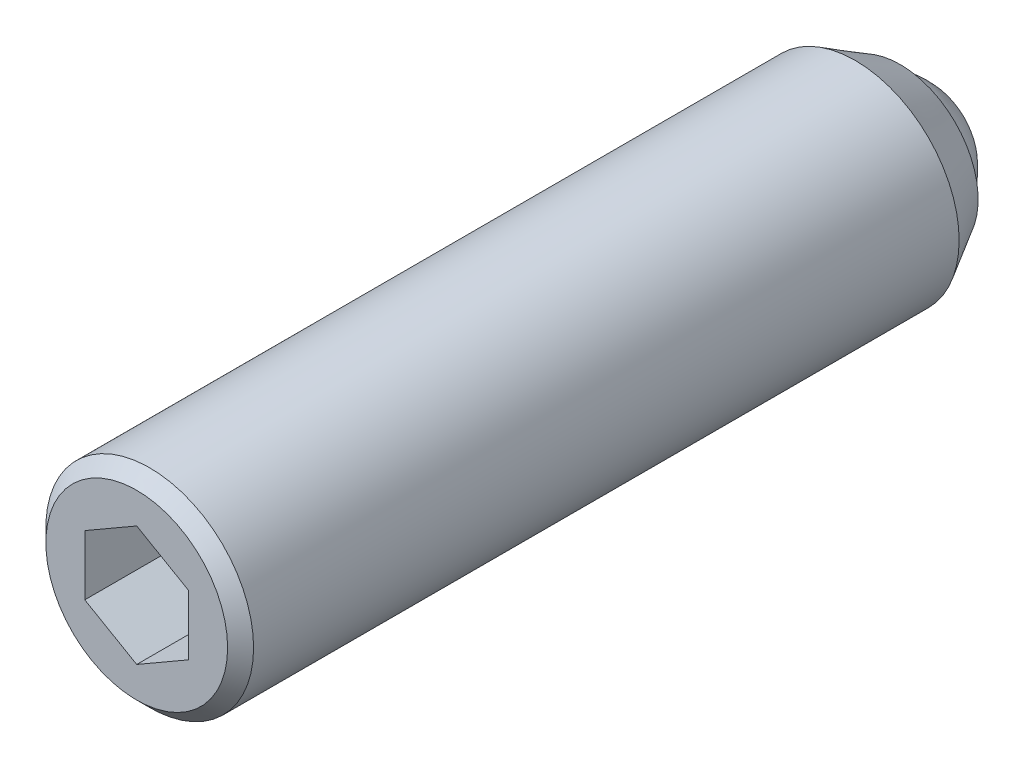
ISO-10303-21;
HEADER;
FILE_DESCRIPTION(('STEP AP214'),'2;1');
FILE_NAME('part.step','',(''),(''),'','','');
FILE_SCHEMA(('AUTOMOTIVE_DESIGN { 1 0 10303 214 1 1 1 1 }'));
ENDSEC;
DATA;
#1=APPLICATION_CONTEXT('core data for automotive mechanical design processes');
#2=APPLICATION_PROTOCOL_DEFINITION('international standard','automotive_design',2000,#1);
#3=PRODUCT_CONTEXT('',#1,'mechanical');
#4=PRODUCT('Part','Part','',(#3));
#5=PRODUCT_RELATED_PRODUCT_CATEGORY('part','',(#4));
#6=PRODUCT_DEFINITION_FORMATION('','',#4);
#7=PRODUCT_DEFINITION_CONTEXT('part definition',#1,'design');
#8=PRODUCT_DEFINITION('design','',#6,#7);
#9=PRODUCT_DEFINITION_SHAPE('','',#8);
#10=(LENGTH_UNIT() NAMED_UNIT(*) SI_UNIT(.MILLI.,.METRE.));
#11=(NAMED_UNIT(*) PLANE_ANGLE_UNIT() SI_UNIT($,.RADIAN.));
#12=(NAMED_UNIT(*) SI_UNIT($,.STERADIAN.) SOLID_ANGLE_UNIT());
#13=UNCERTAINTY_MEASURE_WITH_UNIT(LENGTH_MEASURE(1.E-05),#10,'distance_accuracy_value','');
#14=(GEOMETRIC_REPRESENTATION_CONTEXT(3) GLOBAL_UNCERTAINTY_ASSIGNED_CONTEXT((#13)) GLOBAL_UNIT_ASSIGNED_CONTEXT((#10,
#11,#12)) REPRESENTATION_CONTEXT('',''));
#15=CARTESIAN_POINT('',(0.,0.,0.));
#16=DIRECTION('',(0.,0.,1.));
#17=DIRECTION('',(1.,0.,0.));
#18=AXIS2_PLACEMENT_3D('',#15,#16,#17);
#19=CARTESIAN_POINT('',(2.,1.15470053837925,28.75));
#20=DIRECTION('',(0.5,0.86602540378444,0.));
#21=DIRECTION('',(0.86602540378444,-0.5,0.));
#22=AXIS2_PLACEMENT_3D('',#19,#20,#21);
#23=PLANE('',#22);
#24=DIRECTION('',(0.,0.,1.));
#25=VECTOR('',#24,1.);
#26=CARTESIAN_POINT('',(2.,1.15470053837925,28.75));
#27=LINE('',#26,#25);
#28=CARTESIAN_POINT('',(2.,1.15470053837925,27.25));
#29=VERTEX_POINT('',#28);
#30=CARTESIAN_POINT('',(2.,1.15470053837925,31.25));
#31=VERTEX_POINT('',#30);
#32=EDGE_CURVE('E68',#29,#31,#27,.T.);
#33=ORIENTED_EDGE('',*,*,#32,.T.);
#34=DIRECTION('',(-0.86602540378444,0.5,0.));
#35=VECTOR('',#34,1.);
#36=CARTESIAN_POINT('',(2.,1.15470053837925,31.25));
#37=LINE('',#36,#35);
#38=CARTESIAN_POINT('',(0.,2.3094010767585,31.25));
#39=VERTEX_POINT('',#38);
#40=EDGE_CURVE('E29',#31,#39,#37,.T.);
#41=ORIENTED_EDGE('',*,*,#40,.T.);
#42=DIRECTION('',(0.,0.,1.));
#43=VECTOR('',#42,1.);
#44=CARTESIAN_POINT('',(0.,2.3094010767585,28.75));
#45=LINE('',#44,#43);
#46=CARTESIAN_POINT('',(0.,2.3094010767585,27.25));
#47=VERTEX_POINT('',#46);
#48=EDGE_CURVE('E80',#47,#39,#45,.T.);
#49=ORIENTED_EDGE('',*,*,#48,.F.);
#50=DIRECTION('',(-0.86602540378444,0.5,0.));
#51=VECTOR('',#50,1.);
#52=CARTESIAN_POINT('',(2.,1.15470053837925,27.25));
#53=LINE('',#52,#51);
#54=EDGE_CURVE('E79',#29,#47,#53,.T.);
#55=ORIENTED_EDGE('',*,*,#54,.F.);
#56=EDGE_LOOP('',(#33,#41,#49,#55));
#57=FACE_BOUND('',#56,.T.);
#58=ADVANCED_FACE('F14',(#57),#23,.F.);
#59=CARTESIAN_POINT('',(2.,-1.15470053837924,28.75));
#60=DIRECTION('',(1.,0.,0.));
#61=DIRECTION('',(0.,0.,1.));
#62=AXIS2_PLACEMENT_3D('',#59,#60,#61);
#63=PLANE('',#62);
#64=DIRECTION('',(0.,0.,1.));
#65=VECTOR('',#64,1.);
#66=CARTESIAN_POINT('',(2.,-1.15470053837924,28.75));
#67=LINE('',#66,#65);
#68=CARTESIAN_POINT('',(2.,-1.15470053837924,27.25));
#69=VERTEX_POINT('',#68);
#70=CARTESIAN_POINT('',(2.,-1.15470053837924,31.25));
#71=VERTEX_POINT('',#70);
#72=EDGE_CURVE('E76',#69,#71,#67,.T.);
#73=ORIENTED_EDGE('',*,*,#72,.T.);
#74=DIRECTION('',(0.,1.,0.));
#75=VECTOR('',#74,1.);
#76=CARTESIAN_POINT('',(2.,-1.15470053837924,31.25));
#77=LINE('',#76,#75);
#78=EDGE_CURVE('E75',#71,#31,#77,.T.);
#79=ORIENTED_EDGE('',*,*,#78,.T.);
#80=ORIENTED_EDGE('',*,*,#32,.F.);
#81=DIRECTION('',(0.,1.,0.));
#82=VECTOR('',#81,1.);
#83=CARTESIAN_POINT('',(2.,-1.15470053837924,27.25));
#84=LINE('',#83,#82);
#85=EDGE_CURVE('E72',#69,#29,#84,.T.);
#86=ORIENTED_EDGE('',*,*,#85,.F.);
#87=EDGE_LOOP('',(#73,#79,#80,#86));
#88=FACE_BOUND('',#87,.T.);
#89=ADVANCED_FACE('F70',(#88),#63,.F.);
#90=CARTESIAN_POINT('',(2.,-1.15470053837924,28.75));
#91=DIRECTION('',(-0.5,0.866025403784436,0.));
#92=DIRECTION('',(0.866025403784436,0.5,0.));
#93=AXIS2_PLACEMENT_3D('',#90,#91,#92);
#94=PLANE('',#93);
#95=DIRECTION('',(0.,0.,1.));
#96=VECTOR('',#95,1.);
#97=CARTESIAN_POINT('',(0.,-2.30940107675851,28.75));
#98=LINE('',#97,#96);
#99=CARTESIAN_POINT('',(0.,-2.30940107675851,27.25));
#100=VERTEX_POINT('',#99);
#101=CARTESIAN_POINT('',(0.,-2.30940107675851,31.25));
#102=VERTEX_POINT('',#101);
#103=EDGE_CURVE('E122',#100,#102,#98,.T.);
#104=ORIENTED_EDGE('',*,*,#103,.T.);
#105=DIRECTION('',(-0.866025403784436,-0.5,0.));
#106=VECTOR('',#105,1.);
#107=CARTESIAN_POINT('',(2.,-1.15470053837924,31.25));
#108=LINE('',#107,#106);
#109=EDGE_CURVE('E113',#71,#102,#108,.T.);
#110=ORIENTED_EDGE('',*,*,#109,.F.);
#111=ORIENTED_EDGE('',*,*,#72,.F.);
#112=DIRECTION('',(0.866025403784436,0.5,0.));
#113=VECTOR('',#112,1.);
#114=CARTESIAN_POINT('',(0.,-2.30940107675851,27.25));
#115=LINE('',#114,#113);
#116=EDGE_CURVE('E89',#100,#69,#115,.T.);
#117=ORIENTED_EDGE('',*,*,#116,.F.);
#118=EDGE_LOOP('',(#104,#110,#111,#117));
#119=FACE_BOUND('',#118,.T.);
#120=ADVANCED_FACE('F147',(#119),#94,.T.);
#121=CARTESIAN_POINT('',(-2.,-1.15470053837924,28.75));
#122=DIRECTION('',(-0.5,-0.866025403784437,0.));
#123=DIRECTION('',(-0.866025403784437,0.5,0.));
#124=AXIS2_PLACEMENT_3D('',#121,#122,#123);
#125=PLANE('',#124);
#126=DIRECTION('',(0.,0.,1.));
#127=VECTOR('',#126,1.);
#128=CARTESIAN_POINT('',(-2.,-1.15470053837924,28.75));
#129=LINE('',#128,#127);
#130=CARTESIAN_POINT('',(-2.,-1.15470053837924,27.25));
#131=VERTEX_POINT('',#130);
#132=CARTESIAN_POINT('',(-2.,-1.15470053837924,31.25));
#133=VERTEX_POINT('',#132);
#134=EDGE_CURVE('E120',#131,#133,#129,.T.);
#135=ORIENTED_EDGE('',*,*,#134,.T.);
#136=DIRECTION('',(0.866025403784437,-0.5,0.));
#137=VECTOR('',#136,1.);
#138=CARTESIAN_POINT('',(-2.,-1.15470053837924,31.25));
#139=LINE('',#138,#137);
#140=EDGE_CURVE('E111',#133,#102,#139,.T.);
#141=ORIENTED_EDGE('',*,*,#140,.T.);
#142=ORIENTED_EDGE('',*,*,#103,.F.);
#143=DIRECTION('',(0.866025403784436,-0.5,0.));
#144=VECTOR('',#143,1.);
#145=CARTESIAN_POINT('',(-2.,-1.15470053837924,27.25));
#146=LINE('',#145,#144);
#147=EDGE_CURVE('E101',#131,#100,#146,.T.);
#148=ORIENTED_EDGE('',*,*,#147,.F.);
#149=EDGE_LOOP('',(#135,#141,#142,#148));
#150=FACE_BOUND('',#149,.T.);
#151=ADVANCED_FACE('F157',(#150),#125,.F.);
#152=CARTESIAN_POINT('',(-2.,-1.15470053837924,28.75));
#153=DIRECTION('',(1.,0.,0.));
#154=DIRECTION('',(0.,0.,1.));
#155=AXIS2_PLACEMENT_3D('',#152,#153,#154);
#156=PLANE('',#155);
#157=DIRECTION('',(0.,0.,1.));
#158=VECTOR('',#157,1.);
#159=CARTESIAN_POINT('',(-2.,1.15470053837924,28.75));
#160=LINE('',#159,#158);
#161=CARTESIAN_POINT('',(-2.,1.15470053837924,27.25));
#162=VERTEX_POINT('',#161);
#163=CARTESIAN_POINT('',(-2.,1.15470053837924,31.25));
#164=VERTEX_POINT('',#163);
#165=EDGE_CURVE('E37',#162,#164,#160,.T.);
#166=ORIENTED_EDGE('',*,*,#165,.T.);
#167=DIRECTION('',(0.,1.,0.));
#168=VECTOR('',#167,1.);
#169=CARTESIAN_POINT('',(-2.,-1.15470053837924,31.25));
#170=LINE('',#169,#168);
#171=EDGE_CURVE('E108',#133,#164,#170,.T.);
#172=ORIENTED_EDGE('',*,*,#171,.F.);
#173=ORIENTED_EDGE('',*,*,#134,.F.);
#174=DIRECTION('',(0.,-1.,0.));
#175=VECTOR('',#174,1.);
#176=CARTESIAN_POINT('',(-2.,1.15470053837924,27.25));
#177=LINE('',#176,#175);
#178=EDGE_CURVE('E98',#162,#131,#177,.T.);
#179=ORIENTED_EDGE('',*,*,#178,.F.);
#180=EDGE_LOOP('',(#166,#172,#173,#179));
#181=FACE_BOUND('',#180,.T.);
#182=ADVANCED_FACE('F153',(#181),#156,.T.);
#183=CARTESIAN_POINT('',(-2.,1.15470053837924,28.75));
#184=DIRECTION('',(0.5,-0.866025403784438,0.));
#185=DIRECTION('',(-0.866025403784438,-0.5,0.));
#186=AXIS2_PLACEMENT_3D('',#183,#184,#185);
#187=PLANE('',#186);
#188=ORIENTED_EDGE('',*,*,#165,.F.);
#189=DIRECTION('',(-0.866025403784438,-0.5,0.));
#190=VECTOR('',#189,1.);
#191=CARTESIAN_POINT('',(0.,2.3094010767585,27.25));
#192=LINE('',#191,#190);
#193=EDGE_CURVE('E84',#47,#162,#192,.T.);
#194=ORIENTED_EDGE('',*,*,#193,.F.);
#195=ORIENTED_EDGE('',*,*,#48,.T.);
#196=DIRECTION('',(0.866025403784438,0.5,0.));
#197=VECTOR('',#196,1.);
#198=CARTESIAN_POINT('',(-2.,1.15470053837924,31.25));
#199=LINE('',#198,#197);
#200=EDGE_CURVE('E105',#164,#39,#199,.T.);
#201=ORIENTED_EDGE('',*,*,#200,.F.);
#202=EDGE_LOOP('',(#188,#194,#195,#201));
#203=FACE_BOUND('',#202,.T.);
#204=ADVANCED_FACE('F150',(#203),#187,.T.);
#205=CARTESIAN_POINT('',(0.,0.,31.));
#206=DIRECTION('',(0.,0.,-1.));
#207=DIRECTION('',(1.,0.,0.));
#208=AXIS2_PLACEMENT_3D('',#205,#206,#207);
#209=CYLINDRICAL_SURFACE('',#208,4.);
#210=CARTESIAN_POINT('',(0.,0.,30.75));
#211=DIRECTION('',(0.,0.,-1.));
#212=DIRECTION('',(1.,0.,0.));
#213=AXIS2_PLACEMENT_3D('',#210,#211,#212);
#214=CIRCLE('',#213,4.);
#215=CARTESIAN_POINT('',(4.,0.,30.75));
#216=VERTEX_POINT('',#215);
#217=EDGE_CURVE('E9',#216,#216,#214,.T.);
#218=ORIENTED_EDGE('',*,*,#217,.T.);
#219=EDGE_LOOP('',(#218));
#220=FACE_BOUND('',#219,.T.);
#221=CARTESIAN_POINT('',(0.,0.,3.58205080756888));
#222=DIRECTION('',(0.,0.,-1.));
#223=DIRECTION('',(-1.,0.,0.));
#224=AXIS2_PLACEMENT_3D('',#221,#222,#223);
#225=CIRCLE('',#224,4.);
#226=CARTESIAN_POINT('',(-4.,0.,3.58205080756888));
#227=VERTEX_POINT('',#226);
#228=EDGE_CURVE('E244',#227,#227,#225,.T.);
#229=ORIENTED_EDGE('',*,*,#228,.F.);
#230=EDGE_LOOP('',(#229));
#231=FACE_BOUND('',#230,.T.);
#232=ADVANCED_FACE('F16',(#220,#231),#209,.T.);
#233=CARTESIAN_POINT('',(0.,0.,30.75));
#234=DIRECTION('',(0.,0.,-1.));
#235=DIRECTION('',(1.,0.,0.));
#236=AXIS2_PLACEMENT_3D('',#233,#234,#235);
#237=CONICAL_SURFACE('',#236,4.,0.785398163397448);
#238=CARTESIAN_POINT('',(0.,0.,31.25));
#239=DIRECTION('',(0.,0.,-1.));
#240=DIRECTION('',(1.,0.,0.));
#241=AXIS2_PLACEMENT_3D('',#238,#239,#240);
#242=CIRCLE('',#241,3.5);
#243=CARTESIAN_POINT('',(3.5,0.,31.25));
#244=VERTEX_POINT('',#243);
#245=EDGE_CURVE('E22',#244,#244,#242,.T.);
#246=ORIENTED_EDGE('',*,*,#245,.T.);
#247=EDGE_LOOP('',(#246));
#248=FACE_BOUND('',#247,.T.);
#249=ORIENTED_EDGE('',*,*,#217,.F.);
#250=EDGE_LOOP('',(#249));
#251=FACE_BOUND('',#250,.T.);
#252=ADVANCED_FACE('F127',(#248,#251),#237,.T.);
#253=CARTESIAN_POINT('',(0.,0.,31.25));
#254=DIRECTION('',(0.,0.,-1.));
#255=DIRECTION('',(1.,0.,0.));
#256=AXIS2_PLACEMENT_3D('',#253,#254,#255);
#257=PLANE('',#256);
#258=ORIENTED_EDGE('',*,*,#200,.T.);
#259=ORIENTED_EDGE('',*,*,#40,.F.);
#260=ORIENTED_EDGE('',*,*,#78,.F.);
#261=ORIENTED_EDGE('',*,*,#109,.T.);
#262=ORIENTED_EDGE('',*,*,#140,.F.);
#263=ORIENTED_EDGE('',*,*,#171,.T.);
#264=EDGE_LOOP('',(#258,#259,#260,#261,#262,#263));
#265=FACE_BOUND('',#264,.T.);
#266=ORIENTED_EDGE('',*,*,#245,.F.);
#267=EDGE_LOOP('',(#266));
#268=FACE_BOUND('',#267,.T.);
#269=ADVANCED_FACE('F130',(#265,#268),#257,.F.);
#270=CARTESIAN_POINT('',(2.,1.15470053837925,27.25));
#271=DIRECTION('',(0.,0.,1.));
#272=DIRECTION('',(1.,0.,0.));
#273=AXIS2_PLACEMENT_3D('',#270,#271,#272);
#274=PLANE('',#273);
#275=ORIENTED_EDGE('',*,*,#85,.T.);
#276=ORIENTED_EDGE('',*,*,#54,.T.);
#277=ORIENTED_EDGE('',*,*,#193,.T.);
#278=ORIENTED_EDGE('',*,*,#178,.T.);
#279=ORIENTED_EDGE('',*,*,#147,.T.);
#280=ORIENTED_EDGE('',*,*,#116,.T.);
#281=EDGE_LOOP('',(#275,#276,#277,#278,#279,#280));
#282=FACE_BOUND('',#281,.T.);
#283=ADVANCED_FACE('F86',(#282),#274,.T.);
#284=CARTESIAN_POINT('',(0.,0.,2.75));
#285=DIRECTION('',(0.,0.,-1.));
#286=DIRECTION('',(-1.,0.,0.));
#287=AXIS2_PLACEMENT_3D('',#284,#285,#286);
#288=SPHERICAL_SURFACE('',#287,2.75);
#289=CARTESIAN_POINT('',(0.,0.,1.85));
#290=DIRECTION('',(0.,0.,-1.));
#291=DIRECTION('',(-1.,0.,0.));
#292=AXIS2_PLACEMENT_3D('',#289,#290,#291);
#293=CIRCLE('',#292,2.59855729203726);
#294=CARTESIAN_POINT('',(-2.59855729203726,0.,1.85));
#295=VERTEX_POINT('',#294);
#296=EDGE_CURVE('E90',#295,#295,#293,.T.);
#297=ORIENTED_EDGE('',*,*,#296,.T.);
#298=EDGE_LOOP('',(#297));
#299=FACE_BOUND('',#298,.T.);
#300=ADVANCED_FACE('F139',(#299),#288,.T.);
#301=CARTESIAN_POINT('',(-2.59855729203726,0.,1.85));
#302=DIRECTION('',(0.,0.,-1.));
#303=DIRECTION('',(-1.,0.,0.));
#304=AXIS2_PLACEMENT_3D('',#301,#302,#303);
#305=PLANE('',#304);
#306=CARTESIAN_POINT('',(0.,0.,1.85));
#307=DIRECTION('',(0.,0.,-1.));
#308=DIRECTION('',(-1.,0.,0.));
#309=AXIS2_PLACEMENT_3D('',#306,#307,#308);
#310=CIRCLE('',#309,3.);
#311=CARTESIAN_POINT('',(-3.,0.,1.85));
#312=VERTEX_POINT('',#311);
#313=EDGE_CURVE('E93',#312,#312,#310,.T.);
#314=ORIENTED_EDGE('',*,*,#313,.T.);
#315=EDGE_LOOP('',(#314));
#316=FACE_BOUND('',#315,.T.);
#317=ORIENTED_EDGE('',*,*,#296,.F.);
#318=EDGE_LOOP('',(#317));
#319=FACE_BOUND('',#318,.T.);
#320=ADVANCED_FACE('F216',(#316,#319),#305,.T.);
#321=CARTESIAN_POINT('',(0.,0.,1.85));
#322=DIRECTION('',(0.,0.,1.));
#323=DIRECTION('',(1.,0.,0.));
#324=AXIS2_PLACEMENT_3D('',#321,#322,#323);
#325=CONICAL_SURFACE('',#324,3.,0.523598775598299);
#326=ORIENTED_EDGE('',*,*,#228,.T.);
#327=EDGE_LOOP('',(#326));
#328=FACE_BOUND('',#327,.T.);
#329=ORIENTED_EDGE('',*,*,#313,.F.);
#330=EDGE_LOOP('',(#329));
#331=FACE_BOUND('',#330,.T.);
#332=ADVANCED_FACE('F225',(#328,#331),#325,.T.);
#333=CLOSED_SHELL('',(#58,#89,#120,#151,#182,#204,#232,#252,#269,#283,#300,#320,#332));
#334=MANIFOLD_SOLID_BREP('B1',#333);
#335=ADVANCED_BREP_SHAPE_REPRESENTATION('',(#18,#334),#14);
#336=SHAPE_DEFINITION_REPRESENTATION(#9,#335);
ENDSEC;
END-ISO-10303-21;
